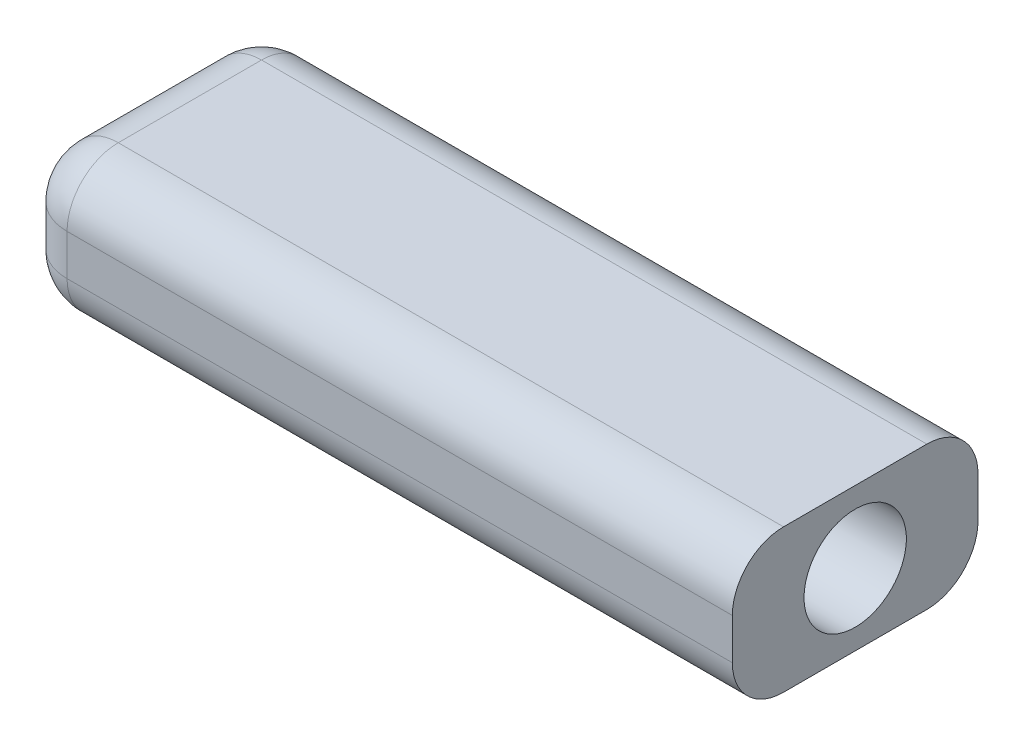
ISO-10303-21;
HEADER;
FILE_DESCRIPTION(('STEP AP214'),'2;1');
FILE_NAME('part.step','',(''),(''),'','','');
FILE_SCHEMA(('AUTOMOTIVE_DESIGN { 1 0 10303 214 1 1 1 1 }'));
ENDSEC;
DATA;
#1=APPLICATION_CONTEXT('core data for automotive mechanical design processes');
#2=APPLICATION_PROTOCOL_DEFINITION('international standard','automotive_design',2000,#1);
#3=PRODUCT_CONTEXT('',#1,'mechanical');
#4=PRODUCT('Part','Part','',(#3));
#5=PRODUCT_RELATED_PRODUCT_CATEGORY('part','',(#4));
#6=PRODUCT_DEFINITION_FORMATION('','',#4);
#7=PRODUCT_DEFINITION_CONTEXT('part definition',#1,'design');
#8=PRODUCT_DEFINITION('design','',#6,#7);
#9=PRODUCT_DEFINITION_SHAPE('','',#8);
#10=(LENGTH_UNIT() NAMED_UNIT(*) SI_UNIT(.MILLI.,.METRE.));
#11=(NAMED_UNIT(*) PLANE_ANGLE_UNIT() SI_UNIT($,.RADIAN.));
#12=(NAMED_UNIT(*) SI_UNIT($,.STERADIAN.) SOLID_ANGLE_UNIT());
#13=UNCERTAINTY_MEASURE_WITH_UNIT(LENGTH_MEASURE(1.E-05),#10,'distance_accuracy_value','');
#14=(GEOMETRIC_REPRESENTATION_CONTEXT(3) GLOBAL_UNCERTAINTY_ASSIGNED_CONTEXT((#13)) GLOBAL_UNIT_ASSIGNED_CONTEXT((#10,
#11,#12)) REPRESENTATION_CONTEXT('',''));
#15=CARTESIAN_POINT('',(0.,0.,0.));
#16=DIRECTION('',(0.,0.,1.));
#17=DIRECTION('',(1.,0.,0.));
#18=AXIS2_PLACEMENT_3D('',#15,#16,#17);
#19=CARTESIAN_POINT('',(35.,14.,-12.));
#20=DIRECTION('',(-1.,0.,0.));
#21=DIRECTION('',(0.,0.,1.));
#22=AXIS2_PLACEMENT_3D('',#19,#20,#21);
#23=PLANE('',#22);
#24=CARTESIAN_POINT('',(35.,7.,0.));
#25=DIRECTION('',(-1.,0.,0.));
#26=DIRECTION('',(0.,0.,1.));
#27=AXIS2_PLACEMENT_3D('',#24,#25,#26);
#28=CIRCLE('',#27,5.);
#29=CARTESIAN_POINT('',(35.,7.,5.));
#30=VERTEX_POINT('',#29);
#31=EDGE_CURVE('E419',#30,#30,#28,.T.);
#32=ORIENTED_EDGE('',*,*,#31,.T.);
#33=EDGE_LOOP('',(#32));
#34=FACE_BOUND('',#33,.T.);
#35=DIRECTION('',(0.,0.,-1.));
#36=VECTOR('',#35,1.);
#37=CARTESIAN_POINT('',(35.,0.,-12.));
#38=LINE('',#37,#36);
#39=CARTESIAN_POINT('',(35.,0.,7.));
#40=VERTEX_POINT('',#39);
#41=CARTESIAN_POINT('',(35.,0.,-7.));
#42=VERTEX_POINT('',#41);
#43=EDGE_CURVE('E198',#40,#42,#38,.T.);
#44=ORIENTED_EDGE('',*,*,#43,.T.);
#45=CARTESIAN_POINT('',(35.,5.,-7.));
#46=DIRECTION('',(-1.,0.,0.));
#47=DIRECTION('',(0.,0.,1.));
#48=AXIS2_PLACEMENT_3D('',#45,#46,#47);
#49=CIRCLE('',#48,5.);
#50=CARTESIAN_POINT('',(35.,5.,-12.));
#51=VERTEX_POINT('',#50);
#52=EDGE_CURVE('E11',#42,#51,#49,.F.);
#53=ORIENTED_EDGE('',*,*,#52,.T.);
#54=DIRECTION('',(0.,-1.,0.));
#55=VECTOR('',#54,1.);
#56=CARTESIAN_POINT('',(35.,14.,-12.));
#57=LINE('',#56,#55);
#58=CARTESIAN_POINT('',(35.,9.,-12.));
#59=VERTEX_POINT('',#58);
#60=EDGE_CURVE('E140',#59,#51,#57,.T.);
#61=ORIENTED_EDGE('',*,*,#60,.F.);
#62=CARTESIAN_POINT('',(35.,9.,-7.));
#63=DIRECTION('',(-1.,0.,0.));
#64=DIRECTION('',(0.,0.,1.));
#65=AXIS2_PLACEMENT_3D('',#62,#63,#64);
#66=CIRCLE('',#65,5.);
#67=CARTESIAN_POINT('',(35.,14.,-7.));
#68=VERTEX_POINT('',#67);
#69=EDGE_CURVE('E41',#59,#68,#66,.F.);
#70=ORIENTED_EDGE('',*,*,#69,.T.);
#71=DIRECTION('',(0.,0.,-1.));
#72=VECTOR('',#71,1.);
#73=CARTESIAN_POINT('',(35.,14.,-12.));
#74=LINE('',#73,#72);
#75=CARTESIAN_POINT('',(35.,14.,7.));
#76=VERTEX_POINT('',#75);
#77=EDGE_CURVE('E201',#76,#68,#74,.T.);
#78=ORIENTED_EDGE('',*,*,#77,.F.);
#79=CARTESIAN_POINT('',(35.,9.,7.));
#80=DIRECTION('',(-1.,0.,0.));
#81=DIRECTION('',(0.,0.,1.));
#82=AXIS2_PLACEMENT_3D('',#79,#80,#81);
#83=CIRCLE('',#82,5.);
#84=CARTESIAN_POINT('',(35.,9.,12.));
#85=VERTEX_POINT('',#84);
#86=EDGE_CURVE('E171',#76,#85,#83,.F.);
#87=ORIENTED_EDGE('',*,*,#86,.T.);
#88=DIRECTION('',(0.,-1.,0.));
#89=VECTOR('',#88,1.);
#90=CARTESIAN_POINT('',(35.,14.,12.));
#91=LINE('',#90,#89);
#92=CARTESIAN_POINT('',(35.,5.,12.));
#93=VERTEX_POINT('',#92);
#94=EDGE_CURVE('E206',#85,#93,#91,.T.);
#95=ORIENTED_EDGE('',*,*,#94,.T.);
#96=CARTESIAN_POINT('',(35.,5.,7.));
#97=DIRECTION('',(-1.,0.,0.));
#98=DIRECTION('',(0.,0.,1.));
#99=AXIS2_PLACEMENT_3D('',#96,#97,#98);
#100=CIRCLE('',#99,5.);
#101=EDGE_CURVE('E173',#93,#40,#100,.F.);
#102=ORIENTED_EDGE('',*,*,#101,.T.);
#103=EDGE_LOOP('',(#44,#53,#61,#70,#78,#87,#95,#102));
#104=FACE_BOUND('',#103,.T.);
#105=ADVANCED_FACE('F32',(#34,#104),#23,.F.);
#106=CARTESIAN_POINT('',(-35.,14.,-12.));
#107=DIRECTION('',(0.,0.,1.));
#108=DIRECTION('',(1.,0.,0.));
#109=AXIS2_PLACEMENT_3D('',#106,#107,#108);
#110=PLANE('',#109);
#111=ORIENTED_EDGE('',*,*,#60,.T.);
#112=DIRECTION('',(-1.,0.,0.));
#113=VECTOR('',#112,1.);
#114=CARTESIAN_POINT('',(-35.,5.,-12.));
#115=LINE('',#114,#113);
#116=CARTESIAN_POINT('',(-30.,5.,-12.));
#117=VERTEX_POINT('',#116);
#118=EDGE_CURVE('E153',#51,#117,#115,.T.);
#119=ORIENTED_EDGE('',*,*,#118,.T.);
#120=DIRECTION('',(0.,-1.,0.));
#121=VECTOR('',#120,1.);
#122=CARTESIAN_POINT('',(-30.,14.,-12.));
#123=LINE('',#122,#121);
#124=CARTESIAN_POINT('',(-30.,9.,-12.));
#125=VERTEX_POINT('',#124);
#126=EDGE_CURVE('E117',#117,#125,#123,.F.);
#127=ORIENTED_EDGE('',*,*,#126,.T.);
#128=DIRECTION('',(-1.,0.,0.));
#129=VECTOR('',#128,1.);
#130=CARTESIAN_POINT('',(35.,9.,-12.));
#131=LINE('',#130,#129);
#132=EDGE_CURVE('E146',#125,#59,#131,.F.);
#133=ORIENTED_EDGE('',*,*,#132,.T.);
#134=EDGE_LOOP('',(#111,#119,#127,#133));
#135=FACE_BOUND('',#134,.T.);
#136=ADVANCED_FACE('F232',(#135),#110,.F.);
#137=CARTESIAN_POINT('',(-35.,14.,-12.));
#138=DIRECTION('',(1.,0.,0.));
#139=DIRECTION('',(0.,0.,-1.));
#140=AXIS2_PLACEMENT_3D('',#137,#138,#139);
#141=PLANE('',#140);
#142=DIRECTION('',(0.,0.,1.));
#143=VECTOR('',#142,1.);
#144=CARTESIAN_POINT('',(-35.,9.,-12.));
#145=LINE('',#144,#143);
#146=CARTESIAN_POINT('',(-35.,9.,7.));
#147=VERTEX_POINT('',#146);
#148=CARTESIAN_POINT('',(-35.,9.,-7.));
#149=VERTEX_POINT('',#148);
#150=EDGE_CURVE('E144',#147,#149,#145,.F.);
#151=ORIENTED_EDGE('',*,*,#150,.T.);
#152=DIRECTION('',(0.,-1.,0.));
#153=VECTOR('',#152,1.);
#154=CARTESIAN_POINT('',(-35.,14.,-7.));
#155=LINE('',#154,#153);
#156=CARTESIAN_POINT('',(-35.,5.,-7.));
#157=VERTEX_POINT('',#156);
#158=EDGE_CURVE('E115',#149,#157,#155,.T.);
#159=ORIENTED_EDGE('',*,*,#158,.T.);
#160=DIRECTION('',(0.,0.,1.));
#161=VECTOR('',#160,1.);
#162=CARTESIAN_POINT('',(-35.,5.,-12.));
#163=LINE('',#162,#161);
#164=CARTESIAN_POINT('',(-35.,5.,7.));
#165=VERTEX_POINT('',#164);
#166=EDGE_CURVE('E133',#157,#165,#163,.T.);
#167=ORIENTED_EDGE('',*,*,#166,.T.);
#168=DIRECTION('',(0.,-1.,0.));
#169=VECTOR('',#168,1.);
#170=CARTESIAN_POINT('',(-35.,14.,7.));
#171=LINE('',#170,#169);
#172=EDGE_CURVE('E139',#165,#147,#171,.F.);
#173=ORIENTED_EDGE('',*,*,#172,.T.);
#174=EDGE_LOOP('',(#151,#159,#167,#173));
#175=FACE_BOUND('',#174,.T.);
#176=ADVANCED_FACE('F142',(#175),#141,.F.);
#177=CARTESIAN_POINT('',(-35.,14.,12.));
#178=DIRECTION('',(0.,0.,-1.));
#179=DIRECTION('',(-1.,0.,0.));
#180=AXIS2_PLACEMENT_3D('',#177,#178,#179);
#181=PLANE('',#180);
#182=DIRECTION('',(0.,-1.,0.));
#183=VECTOR('',#182,1.);
#184=CARTESIAN_POINT('',(-30.,14.,12.));
#185=LINE('',#184,#183);
#186=CARTESIAN_POINT('',(-30.,9.,12.));
#187=VERTEX_POINT('',#186);
#188=CARTESIAN_POINT('',(-30.,5.,12.));
#189=VERTEX_POINT('',#188);
#190=EDGE_CURVE('E163',#187,#189,#185,.T.);
#191=ORIENTED_EDGE('',*,*,#190,.T.);
#192=DIRECTION('',(1.,0.,0.));
#193=VECTOR('',#192,1.);
#194=CARTESIAN_POINT('',(-35.,5.,12.));
#195=LINE('',#194,#193);
#196=EDGE_CURVE('E165',#189,#93,#195,.T.);
#197=ORIENTED_EDGE('',*,*,#196,.T.);
#198=ORIENTED_EDGE('',*,*,#94,.F.);
#199=DIRECTION('',(1.,0.,0.));
#200=VECTOR('',#199,1.);
#201=CARTESIAN_POINT('',(-35.,9.,12.));
#202=LINE('',#201,#200);
#203=EDGE_CURVE('E161',#85,#187,#202,.F.);
#204=ORIENTED_EDGE('',*,*,#203,.T.);
#205=EDGE_LOOP('',(#191,#197,#198,#204));
#206=FACE_BOUND('',#205,.T.);
#207=ADVANCED_FACE('F377',(#206),#181,.F.);
#208=CARTESIAN_POINT('',(0.,14.,0.));
#209=DIRECTION('',(0.,1.,0.));
#210=DIRECTION('',(0.,0.,1.));
#211=AXIS2_PLACEMENT_3D('',#208,#209,#210);
#212=PLANE('',#211);
#213=ORIENTED_EDGE('',*,*,#77,.T.);
#214=DIRECTION('',(-1.,0.,0.));
#215=VECTOR('',#214,1.);
#216=CARTESIAN_POINT('',(-35.,14.,-7.));
#217=LINE('',#216,#215);
#218=CARTESIAN_POINT('',(-30.,14.,-7.));
#219=VERTEX_POINT('',#218);
#220=EDGE_CURVE('E159',#68,#219,#217,.T.);
#221=ORIENTED_EDGE('',*,*,#220,.T.);
#222=DIRECTION('',(0.,0.,1.));
#223=VECTOR('',#222,1.);
#224=CARTESIAN_POINT('',(-30.,14.,12.));
#225=LINE('',#224,#223);
#226=CARTESIAN_POINT('',(-30.,14.,7.));
#227=VERTEX_POINT('',#226);
#228=EDGE_CURVE('E157',#219,#227,#225,.T.);
#229=ORIENTED_EDGE('',*,*,#228,.T.);
#230=DIRECTION('',(1.,0.,0.));
#231=VECTOR('',#230,1.);
#232=CARTESIAN_POINT('',(35.,14.,7.));
#233=LINE('',#232,#231);
#234=EDGE_CURVE('E155',#227,#76,#233,.T.);
#235=ORIENTED_EDGE('',*,*,#234,.T.);
#236=EDGE_LOOP('',(#213,#221,#229,#235));
#237=FACE_BOUND('',#236,.T.);
#238=ADVANCED_FACE('F369',(#237),#212,.T.);
#239=CARTESIAN_POINT('',(0.,0.,0.));
#240=DIRECTION('',(0.,1.,0.));
#241=DIRECTION('',(0.,0.,1.));
#242=AXIS2_PLACEMENT_3D('',#239,#240,#241);
#243=PLANE('',#242);
#244=DIRECTION('',(0.,0.,1.));
#245=VECTOR('',#244,1.);
#246=CARTESIAN_POINT('',(-30.,0.,0.));
#247=LINE('',#246,#245);
#248=CARTESIAN_POINT('',(-30.,0.,7.));
#249=VERTEX_POINT('',#248);
#250=CARTESIAN_POINT('',(-30.,0.,-7.));
#251=VERTEX_POINT('',#250);
#252=EDGE_CURVE('E49',#249,#251,#247,.F.);
#253=ORIENTED_EDGE('',*,*,#252,.T.);
#254=DIRECTION('',(-1.,0.,0.));
#255=VECTOR('',#254,1.);
#256=CARTESIAN_POINT('',(0.,0.,-7.));
#257=LINE('',#256,#255);
#258=EDGE_CURVE('E169',#251,#42,#257,.F.);
#259=ORIENTED_EDGE('',*,*,#258,.T.);
#260=ORIENTED_EDGE('',*,*,#43,.F.);
#261=DIRECTION('',(1.,0.,0.));
#262=VECTOR('',#261,1.);
#263=CARTESIAN_POINT('',(0.,0.,7.));
#264=LINE('',#263,#262);
#265=EDGE_CURVE('E54',#40,#249,#264,.F.);
#266=ORIENTED_EDGE('',*,*,#265,.T.);
#267=EDGE_LOOP('',(#253,#259,#260,#266));
#268=FACE_BOUND('',#267,.T.);
#269=ADVANCED_FACE('F236',(#268),#243,.F.);
#270=CARTESIAN_POINT('',(0.,9.,7.));
#271=DIRECTION('',(-1.,0.,0.));
#272=DIRECTION('',(0.,0.,1.));
#273=AXIS2_PLACEMENT_3D('',#270,#271,#272);
#274=CYLINDRICAL_SURFACE('',#273,5.);
#275=ORIENTED_EDGE('',*,*,#86,.F.);
#276=ORIENTED_EDGE('',*,*,#234,.F.);
#277=CARTESIAN_POINT('',(-30.,9.,7.));
#278=DIRECTION('',(-1.,0.,0.));
#279=DIRECTION('',(0.,0.,1.));
#280=AXIS2_PLACEMENT_3D('',#277,#278,#279);
#281=CIRCLE('',#280,5.);
#282=EDGE_CURVE('E36',#187,#227,#281,.T.);
#283=ORIENTED_EDGE('',*,*,#282,.F.);
#284=ORIENTED_EDGE('',*,*,#203,.F.);
#285=EDGE_LOOP('',(#275,#276,#283,#284));
#286=FACE_BOUND('',#285,.T.);
#287=ADVANCED_FACE('F34',(#286),#274,.T.);
#288=CARTESIAN_POINT('',(-30.,14.,7.));
#289=DIRECTION('',(0.,-1.,0.));
#290=DIRECTION('',(0.,0.,-1.));
#291=AXIS2_PLACEMENT_3D('',#288,#289,#290);
#292=CYLINDRICAL_SURFACE('',#291,5.);
#293=CARTESIAN_POINT('',(-30.,5.,7.));
#294=DIRECTION('',(0.,-1.,0.));
#295=DIRECTION('',(0.,0.,-1.));
#296=AXIS2_PLACEMENT_3D('',#293,#294,#295);
#297=CIRCLE('',#296,5.);
#298=EDGE_CURVE('E190',#189,#165,#297,.T.);
#299=ORIENTED_EDGE('',*,*,#298,.F.);
#300=ORIENTED_EDGE('',*,*,#190,.F.);
#301=CARTESIAN_POINT('',(-30.,9.,7.));
#302=DIRECTION('',(0.,1.,0.));
#303=DIRECTION('',(0.,0.,1.));
#304=AXIS2_PLACEMENT_3D('',#301,#302,#303);
#305=CIRCLE('',#304,5.);
#306=EDGE_CURVE('E192',#147,#187,#305,.T.);
#307=ORIENTED_EDGE('',*,*,#306,.F.);
#308=ORIENTED_EDGE('',*,*,#172,.F.);
#309=EDGE_LOOP('',(#299,#300,#307,#308));
#310=FACE_BOUND('',#309,.T.);
#311=ADVANCED_FACE('F216',(#310),#292,.T.);
#312=CARTESIAN_POINT('',(-35.,5.,7.));
#313=DIRECTION('',(1.,0.,0.));
#314=DIRECTION('',(0.,0.,-1.));
#315=AXIS2_PLACEMENT_3D('',#312,#313,#314);
#316=CYLINDRICAL_SURFACE('',#315,5.);
#317=ORIENTED_EDGE('',*,*,#101,.F.);
#318=ORIENTED_EDGE('',*,*,#196,.F.);
#319=CARTESIAN_POINT('',(-30.,5.,7.));
#320=DIRECTION('',(-1.,0.,0.));
#321=DIRECTION('',(0.,0.,1.));
#322=AXIS2_PLACEMENT_3D('',#319,#320,#321);
#323=CIRCLE('',#322,5.);
#324=EDGE_CURVE('E187',#249,#189,#323,.T.);
#325=ORIENTED_EDGE('',*,*,#324,.F.);
#326=ORIENTED_EDGE('',*,*,#265,.F.);
#327=EDGE_LOOP('',(#317,#318,#325,#326));
#328=FACE_BOUND('',#327,.T.);
#329=ADVANCED_FACE('F239',(#328),#316,.T.);
#330=CARTESIAN_POINT('',(-30.,9.,7.));
#331=DIRECTION('',(0.,0.,1.));
#332=DIRECTION('',(1.,0.,0.));
#333=AXIS2_PLACEMENT_3D('',#330,#331,#332);
#334=SPHERICAL_SURFACE('',#333,5.);
#335=ORIENTED_EDGE('',*,*,#306,.T.);
#336=ORIENTED_EDGE('',*,*,#282,.T.);
#337=CARTESIAN_POINT('',(-30.,9.,7.));
#338=DIRECTION('',(0.,0.,1.));
#339=DIRECTION('',(1.,0.,0.));
#340=AXIS2_PLACEMENT_3D('',#337,#338,#339);
#341=CIRCLE('',#340,5.);
#342=EDGE_CURVE('E184',#147,#227,#341,.F.);
#343=ORIENTED_EDGE('',*,*,#342,.F.);
#344=EDGE_LOOP('',(#335,#336,#343));
#345=FACE_BOUND('',#344,.T.);
#346=ADVANCED_FACE('F217',(#345),#334,.T.);
#347=CARTESIAN_POINT('',(-30.,5.,7.));
#348=DIRECTION('',(0.,0.,1.));
#349=DIRECTION('',(1.,0.,0.));
#350=AXIS2_PLACEMENT_3D('',#347,#348,#349);
#351=SPHERICAL_SURFACE('',#350,5.);
#352=ORIENTED_EDGE('',*,*,#324,.T.);
#353=ORIENTED_EDGE('',*,*,#298,.T.);
#354=CARTESIAN_POINT('',(-30.,5.,7.));
#355=DIRECTION('',(0.,0.,1.));
#356=DIRECTION('',(1.,0.,0.));
#357=AXIS2_PLACEMENT_3D('',#354,#355,#356);
#358=CIRCLE('',#357,5.);
#359=EDGE_CURVE('E136',#249,#165,#358,.F.);
#360=ORIENTED_EDGE('',*,*,#359,.F.);
#361=EDGE_LOOP('',(#352,#353,#360));
#362=FACE_BOUND('',#361,.T.);
#363=ADVANCED_FACE('F242',(#362),#351,.T.);
#364=CARTESIAN_POINT('',(0.,9.,-7.));
#365=DIRECTION('',(1.,0.,0.));
#366=DIRECTION('',(0.,0.,-1.));
#367=AXIS2_PLACEMENT_3D('',#364,#365,#366);
#368=CYLINDRICAL_SURFACE('',#367,5.);
#369=ORIENTED_EDGE('',*,*,#69,.F.);
#370=ORIENTED_EDGE('',*,*,#132,.F.);
#371=CARTESIAN_POINT('',(-30.,9.,-7.));
#372=DIRECTION('',(-1.,0.,0.));
#373=DIRECTION('',(0.,0.,1.));
#374=AXIS2_PLACEMENT_3D('',#371,#372,#373);
#375=CIRCLE('',#374,5.);
#376=EDGE_CURVE('E180',#219,#125,#375,.T.);
#377=ORIENTED_EDGE('',*,*,#376,.F.);
#378=ORIENTED_EDGE('',*,*,#220,.F.);
#379=EDGE_LOOP('',(#369,#370,#377,#378));
#380=FACE_BOUND('',#379,.T.);
#381=ADVANCED_FACE('F229',(#380),#368,.T.);
#382=CARTESIAN_POINT('',(-30.,9.,0.));
#383=DIRECTION('',(0.,0.,-1.));
#384=DIRECTION('',(-1.,0.,0.));
#385=AXIS2_PLACEMENT_3D('',#382,#383,#384);
#386=CYLINDRICAL_SURFACE('',#385,5.);
#387=ORIENTED_EDGE('',*,*,#342,.T.);
#388=ORIENTED_EDGE('',*,*,#228,.F.);
#389=CARTESIAN_POINT('',(-30.,9.,-7.));
#390=DIRECTION('',(0.,0.,-1.));
#391=DIRECTION('',(-1.,0.,0.));
#392=AXIS2_PLACEMENT_3D('',#389,#390,#391);
#393=CIRCLE('',#392,5.);
#394=EDGE_CURVE('E130',#149,#219,#393,.T.);
#395=ORIENTED_EDGE('',*,*,#394,.F.);
#396=ORIENTED_EDGE('',*,*,#150,.F.);
#397=EDGE_LOOP('',(#387,#388,#395,#396));
#398=FACE_BOUND('',#397,.T.);
#399=ADVANCED_FACE('F220',(#398),#386,.T.);
#400=CARTESIAN_POINT('',(-30.,5.,-12.));
#401=DIRECTION('',(0.,0.,1.));
#402=DIRECTION('',(1.,0.,0.));
#403=AXIS2_PLACEMENT_3D('',#400,#401,#402);
#404=CYLINDRICAL_SURFACE('',#403,5.);
#405=ORIENTED_EDGE('',*,*,#359,.T.);
#406=ORIENTED_EDGE('',*,*,#166,.F.);
#407=CARTESIAN_POINT('',(-30.,5.,-7.));
#408=DIRECTION('',(0.,0.,-1.));
#409=DIRECTION('',(-1.,0.,0.));
#410=AXIS2_PLACEMENT_3D('',#407,#408,#409);
#411=CIRCLE('',#410,5.);
#412=EDGE_CURVE('E124',#251,#157,#411,.T.);
#413=ORIENTED_EDGE('',*,*,#412,.F.);
#414=ORIENTED_EDGE('',*,*,#252,.F.);
#415=EDGE_LOOP('',(#405,#406,#413,#414));
#416=FACE_BOUND('',#415,.T.);
#417=ADVANCED_FACE('F134',(#416),#404,.T.);
#418=CARTESIAN_POINT('',(-35.,5.,-7.));
#419=DIRECTION('',(-1.,0.,0.));
#420=DIRECTION('',(0.,0.,1.));
#421=AXIS2_PLACEMENT_3D('',#418,#419,#420);
#422=CYLINDRICAL_SURFACE('',#421,5.);
#423=ORIENTED_EDGE('',*,*,#52,.F.);
#424=ORIENTED_EDGE('',*,*,#258,.F.);
#425=CARTESIAN_POINT('',(-30.,5.,-7.));
#426=DIRECTION('',(-1.,0.,0.));
#427=DIRECTION('',(0.,0.,1.));
#428=AXIS2_PLACEMENT_3D('',#425,#426,#427);
#429=CIRCLE('',#428,5.);
#430=EDGE_CURVE('E128',#117,#251,#429,.T.);
#431=ORIENTED_EDGE('',*,*,#430,.F.);
#432=ORIENTED_EDGE('',*,*,#118,.F.);
#433=EDGE_LOOP('',(#423,#424,#431,#432));
#434=FACE_BOUND('',#433,.T.);
#435=ADVANCED_FACE('F235',(#434),#422,.T.);
#436=CARTESIAN_POINT('',(-30.,9.,-7.));
#437=DIRECTION('',(0.,0.,1.));
#438=DIRECTION('',(1.,0.,0.));
#439=AXIS2_PLACEMENT_3D('',#436,#437,#438);
#440=SPHERICAL_SURFACE('',#439,5.);
#441=ORIENTED_EDGE('',*,*,#394,.T.);
#442=ORIENTED_EDGE('',*,*,#376,.T.);
#443=CARTESIAN_POINT('',(-30.,9.,-7.));
#444=DIRECTION('',(0.,1.,0.));
#445=DIRECTION('',(0.,0.,1.));
#446=AXIS2_PLACEMENT_3D('',#443,#444,#445);
#447=CIRCLE('',#446,5.);
#448=EDGE_CURVE('E120',#149,#125,#447,.F.);
#449=ORIENTED_EDGE('',*,*,#448,.F.);
#450=EDGE_LOOP('',(#441,#442,#449));
#451=FACE_BOUND('',#450,.T.);
#452=ADVANCED_FACE('F224',(#451),#440,.T.);
#453=CARTESIAN_POINT('',(-30.,5.,-7.));
#454=DIRECTION('',(0.,0.,1.));
#455=DIRECTION('',(1.,0.,0.));
#456=AXIS2_PLACEMENT_3D('',#453,#454,#455);
#457=SPHERICAL_SURFACE('',#456,5.);
#458=ORIENTED_EDGE('',*,*,#430,.T.);
#459=ORIENTED_EDGE('',*,*,#412,.T.);
#460=CARTESIAN_POINT('',(-30.,5.,-7.));
#461=DIRECTION('',(0.,-1.,0.));
#462=DIRECTION('',(0.,0.,-1.));
#463=AXIS2_PLACEMENT_3D('',#460,#461,#462);
#464=CIRCLE('',#463,5.);
#465=EDGE_CURVE('E111',#117,#157,#464,.F.);
#466=ORIENTED_EDGE('',*,*,#465,.F.);
#467=EDGE_LOOP('',(#458,#459,#466));
#468=FACE_BOUND('',#467,.T.);
#469=ADVANCED_FACE('F126',(#468),#457,.T.);
#470=CARTESIAN_POINT('',(-30.,14.,-7.));
#471=DIRECTION('',(0.,-1.,0.));
#472=DIRECTION('',(0.,0.,-1.));
#473=AXIS2_PLACEMENT_3D('',#470,#471,#472);
#474=CYLINDRICAL_SURFACE('',#473,5.);
#475=ORIENTED_EDGE('',*,*,#448,.T.);
#476=ORIENTED_EDGE('',*,*,#126,.F.);
#477=ORIENTED_EDGE('',*,*,#465,.T.);
#478=ORIENTED_EDGE('',*,*,#158,.F.);
#479=EDGE_LOOP('',(#475,#476,#477,#478));
#480=FACE_BOUND('',#479,.T.);
#481=ADVANCED_FACE('F113',(#480),#474,.T.);
#482=CARTESIAN_POINT('',(-20.,7.,0.));
#483=DIRECTION('',(1.,0.,0.));
#484=DIRECTION('',(0.,0.,-1.));
#485=AXIS2_PLACEMENT_3D('',#482,#483,#484);
#486=CYLINDRICAL_SURFACE('',#485,5.);
#487=CARTESIAN_POINT('',(-20.,7.,0.));
#488=DIRECTION('',(-1.,0.,0.));
#489=DIRECTION('',(0.,0.,1.));
#490=AXIS2_PLACEMENT_3D('',#487,#488,#489);
#491=CIRCLE('',#490,5.);
#492=CARTESIAN_POINT('',(-20.,7.,5.));
#493=VERTEX_POINT('',#492);
#494=EDGE_CURVE('E121',#493,#493,#491,.T.);
#495=ORIENTED_EDGE('',*,*,#494,.T.);
#496=EDGE_LOOP('',(#495));
#497=FACE_BOUND('',#496,.T.);
#498=ORIENTED_EDGE('',*,*,#31,.F.);
#499=EDGE_LOOP('',(#498));
#500=FACE_BOUND('',#499,.T.);
#501=ADVANCED_FACE('F263',(#497,#500),#486,.F.);
#502=CARTESIAN_POINT('',(-20.,7.,0.));
#503=DIRECTION('',(-1.,0.,0.));
#504=DIRECTION('',(0.,0.,1.));
#505=AXIS2_PLACEMENT_3D('',#502,#503,#504);
#506=PLANE('',#505);
#507=ORIENTED_EDGE('',*,*,#494,.F.);
#508=EDGE_LOOP('',(#507));
#509=FACE_BOUND('',#508,.T.);
#510=ADVANCED_FACE('F303',(#509),#506,.F.);
#511=CLOSED_SHELL('',(#105,#136,#176,#207,#238,#269,#287,#311,#329,#346,#363,#381,#399,#417,
#435,#452,#469,#481,#501,#510));
#512=MANIFOLD_SOLID_BREP('B2',#511);
#513=ADVANCED_BREP_SHAPE_REPRESENTATION('',(#18,#512),#14);
#514=SHAPE_DEFINITION_REPRESENTATION(#9,#513);
ENDSEC;
END-ISO-10303-21;
